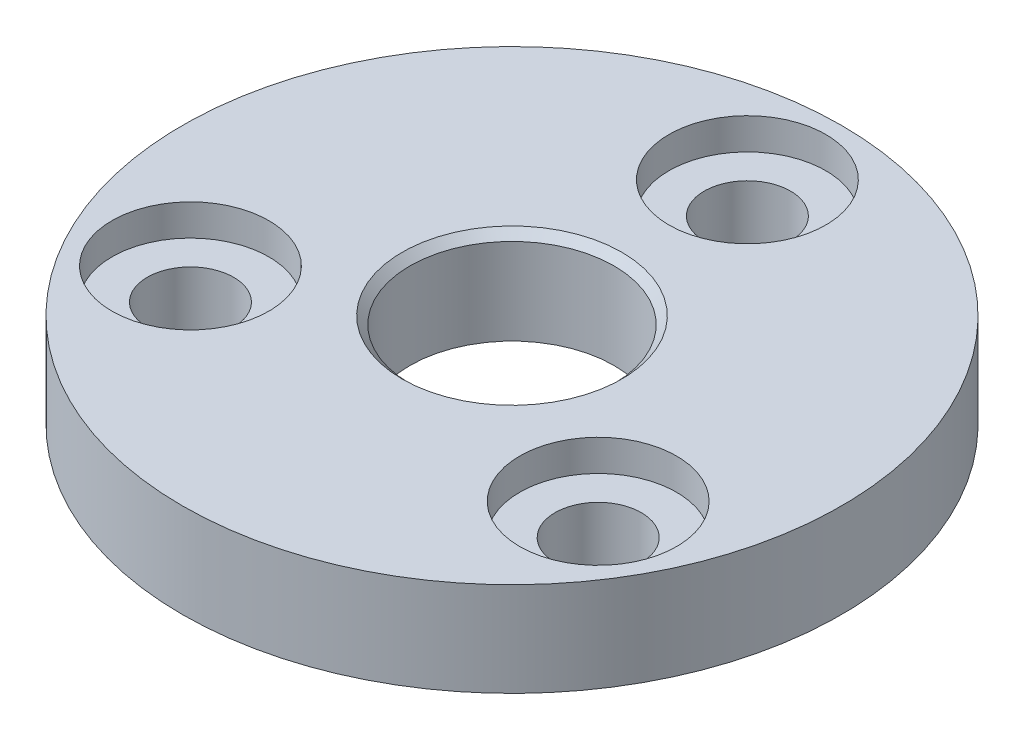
from build123d import *

# Parameters (mm, degrees)
SKETCH2_R                      = 21
BOSS_EXTRUDE1_DEPTH            = 3
CBORE_FOR_M5_SHCS2_D           = 5.5
CBORE_FOR_M5_SHCS2_CBORE_D     = 10
CBORE_FOR_M5_SHCS2_CBORE_DEPTH = 2
CIRPATTERN3_COUNT              = 3
M12_CLEARANCE_HOLE1_D          = 13
CHAMFER2_SIZE                  = 0.5


with BuildPart() as part:
    # Sketch2 → Boss-Extrude1 (new, symmetric)
    with BuildSketch(Plane(origin=(0, 0, 0), x_dir=(1, 0, 0), z_dir=(0, 1, 0))):
        with Locations(Location((0, 0, 0), (0, 0, 270))):
            Circle(SKETCH2_R)
    extrude(amount=BOSS_EXTRUDE1_DEPTH, both=True)

    # CBORE for M5 SHCS2 (through all)
    with Locations(Plane(origin=(0, 3, 0), x_dir=(1, 0, 0), z_dir=(0, 1, 0))):
        with Locations((0, 15)):
            cbore_for_m5_shcs2 = CounterBoreHole(CBORE_FOR_M5_SHCS2_D / 2, CBORE_FOR_M5_SHCS2_CBORE_D / 2, CBORE_FOR_M5_SHCS2_CBORE_DEPTH)

    # CirPattern3: CBORE for M5 SHCS2 ×3 about axis
    cirpattern3_axis = Axis((0, 0, 0), (0, 1, 0))
    for i in range(1, CIRPATTERN3_COUNT):
        add(cbore_for_m5_shcs2.rotate(cirpattern3_axis, i * 360 / CIRPATTERN3_COUNT), mode=Mode.SUBTRACT)

    # M12 Clearance Hole1 (through all)
    with Locations(Plane(origin=(0, 3, 0), x_dir=(1, 0, 0), z_dir=(0, 1, 0))):
        with Locations((0, 0)):
            Hole(M12_CLEARANCE_HOLE1_D / 2)

    # Chamfer2
    chamfer2_edges = [part.edges().sort_by_distance(p)[0] for p in [
        (6.5, 3, 0),
    ]]
    chamfer(chamfer2_edges, length=CHAMFER2_SIZE)


solid = part.part
